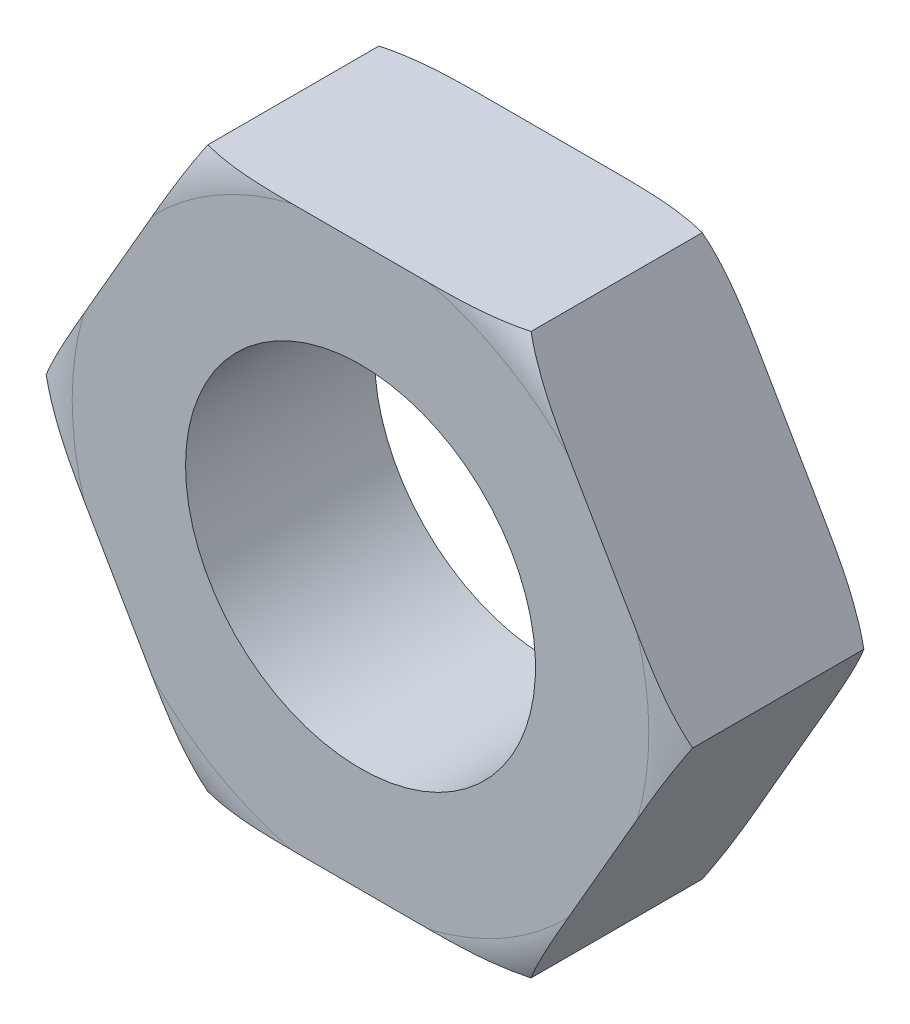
from build123d import *

# Parameters (mm, degrees)
SKETCH1_R           = 2.5
BOSS_EXTRUDE1_DEPTH = 2.7


with BuildPart() as part:
    # Sketch1 → Boss-Extrude1 (new body)
    with BuildSketch(Plane.XY):
        Polygon((4.618802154, 0), (2.309401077, 4), (-2.309401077, 4), (-4.618802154, 0), (-2.309401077, -4), (2.309401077, -4), align=None)
        with Locations(Location((0, 0, 0), (0, 0, 180))):
            Circle(SKETCH1_R, mode=Mode.SUBTRACT)
    extrude(amount=BOSS_EXTRUDE1_DEPTH)

    # Sketch2 → Cut-Revolve1 (revolve, cut)
    with BuildSketch(Plane.XZ):
        with BuildLine():
            Line((-4.119395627, 2.7), (-4.618802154, 2.7))
            Line((-4.618802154, 2.7), (-4.618802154, 2.573))
            ThreePointArc((-4.618802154, 2.573), (-4.377046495, 2.667752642), (-4.119395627, 2.7))
        make_face()
    cut_revolve1 = revolve(axis=Axis((0, 0, 2.7), (0, 0, -1)), mode=Mode.SUBTRACT)

    # Mirror1: Cut-Revolve1 across plane
    add(cut_revolve1.mirror(Plane(origin=(0, 0, 1.35), x_dir=(1, 0, 0), z_dir=(0, 0, -1))), mode=Mode.SUBTRACT)


solid = part.part
